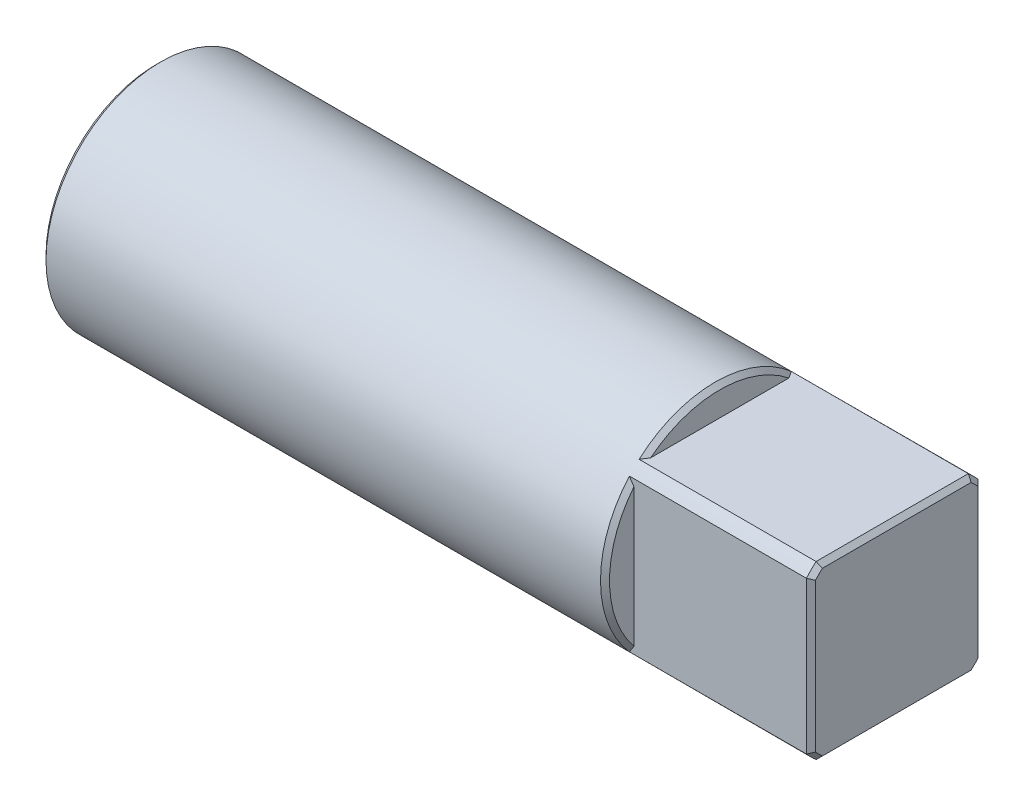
from build123d import *

# Parameters (mm, degrees)
SKETCH_1_R           = 6.35
EXTRUDE_1_DEPTH      = 41
SKETCH_2_OUTSIDE_W   = 23.652
SKETCH_2_OUTSIDE_H   = 23.652
SKETCH_2_OUTSIDE_W_2 = 9.5
SKETCH_2_OUTSIDE_H_2 = 9.5
CUT_EXTRUDE_1_DEPTH  = 9.8
CHAMFER_1_SIZE       = 0.25


with BuildPart() as part:
    # Sketch 1 → Extrude 1 (new body)
    with BuildSketch(Plane(origin=(0, 0, 0), x_dir=(0, 0, -1), z_dir=(1, 0, 0))):
        Circle(SKETCH_1_R)
    extrude(amount=EXTRUDE_1_DEPTH)

    # Sketch 2 outside → Cut-Extrude 1 (cut)
    with BuildSketch(Plane(origin=(41, 0, 0), x_dir=(0, 0, -1), z_dir=(1, 0, 0))):
        Rectangle(SKETCH_2_OUTSIDE_W, SKETCH_2_OUTSIDE_H)
        Rectangle(SKETCH_2_OUTSIDE_W_2, SKETCH_2_OUTSIDE_H_2, mode=Mode.SUBTRACT)
    extrude(amount=-CUT_EXTRUDE_1_DEPTH, mode=Mode.SUBTRACT)

    # Chamfer 1
    chamfer_1_edges = [part.edges().sort_by_distance(p)[0] for p in [
        (31.2, 2.253885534, -5.936539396),
        (31.2, 6.35, 0),
        (31.2, 0, 6.35),
        (0, 0, 6.35),
        (41, 4.490128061, -4.490128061),
        (41, 4.490128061, 4.490128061),
        (41, -4.490128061, 4.490128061),
        (41, -4.490128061, -4.490128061),
        (41, -4.75, 0),
        (41, 0, -4.75),
        (41, 4.75, 0),
        (41, 0, 4.75),
        (31.2, -6.35, 0),
    ]]
    chamfer(chamfer_1_edges, length=CHAMFER_1_SIZE)


solid = part.part
